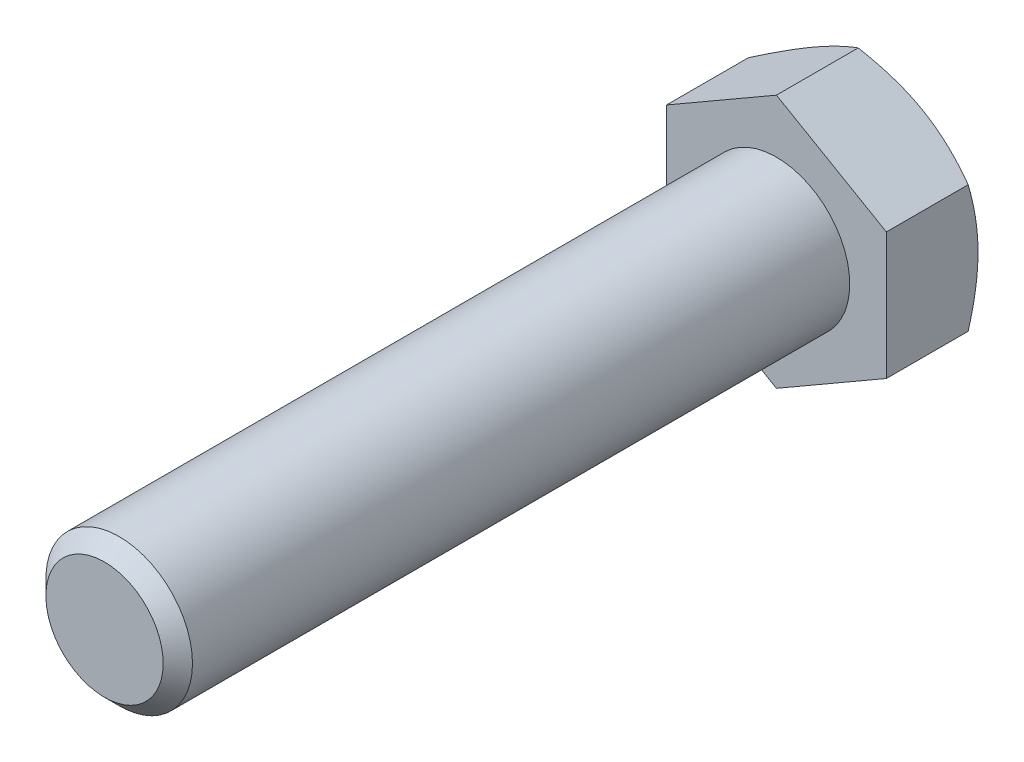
ISO-10303-21;
HEADER;
FILE_DESCRIPTION(('STEP AP214'),'2;1');
FILE_NAME('part.step','',(''),(''),'','','');
FILE_SCHEMA(('AUTOMOTIVE_DESIGN { 1 0 10303 214 1 1 1 1 }'));
ENDSEC;
DATA;
#1=APPLICATION_CONTEXT('core data for automotive mechanical design processes');
#2=APPLICATION_PROTOCOL_DEFINITION('international standard','automotive_design',2000,#1);
#3=PRODUCT_CONTEXT('',#1,'mechanical');
#4=PRODUCT('Part','Part','',(#3));
#5=PRODUCT_RELATED_PRODUCT_CATEGORY('part','',(#4));
#6=PRODUCT_DEFINITION_FORMATION('','',#4);
#7=PRODUCT_DEFINITION_CONTEXT('part definition',#1,'design');
#8=PRODUCT_DEFINITION('design','',#6,#7);
#9=PRODUCT_DEFINITION_SHAPE('','',#8);
#10=(LENGTH_UNIT() NAMED_UNIT(*) SI_UNIT(.MILLI.,.METRE.));
#11=(NAMED_UNIT(*) PLANE_ANGLE_UNIT() SI_UNIT($,.RADIAN.));
#12=(NAMED_UNIT(*) SI_UNIT($,.STERADIAN.) SOLID_ANGLE_UNIT());
#13=UNCERTAINTY_MEASURE_WITH_UNIT(LENGTH_MEASURE(1.E-05),#10,'distance_accuracy_value','');
#14=(GEOMETRIC_REPRESENTATION_CONTEXT(3) GLOBAL_UNCERTAINTY_ASSIGNED_CONTEXT((#13)) GLOBAL_UNIT_ASSIGNED_CONTEXT((#10,
#11,#12)) REPRESENTATION_CONTEXT('',''));
#15=CARTESIAN_POINT('',(0.,0.,0.));
#16=DIRECTION('',(0.,0.,1.));
#17=DIRECTION('',(1.,0.,0.));
#18=AXIS2_PLACEMENT_3D('',#15,#16,#17);
#19=CARTESIAN_POINT('',(0.,0.,55.));
#20=DIRECTION('',(0.,0.,1.));
#21=DIRECTION('',(1.,0.,0.));
#22=AXIS2_PLACEMENT_3D('',#19,#20,#21);
#23=PLANE('',#22);
#24=CARTESIAN_POINT('',(0.,0.,55.));
#25=DIRECTION('',(0.,0.,1.));
#26=DIRECTION('',(1.,0.,0.));
#27=AXIS2_PLACEMENT_3D('',#24,#25,#26);
#28=CIRCLE('',#27,4.80000000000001);
#29=CARTESIAN_POINT('',(4.80000000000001,0.,55.));
#30=VERTEX_POINT('',#29);
#31=EDGE_CURVE('E269',#30,#30,#28,.T.);
#32=ORIENTED_EDGE('',*,*,#31,.T.);
#33=EDGE_LOOP('',(#32));
#34=FACE_BOUND('',#33,.T.);
#35=ADVANCED_FACE('F38',(#34),#23,.T.);
#36=CARTESIAN_POINT('',(0.,0.,0.));
#37=DIRECTION('',(0.,0.,1.));
#38=DIRECTION('',(1.,0.,0.));
#39=AXIS2_PLACEMENT_3D('',#36,#37,#38);
#40=CYLINDRICAL_SURFACE('',#39,6.);
#41=CARTESIAN_POINT('',(0.,0.,53.8));
#42=DIRECTION('',(0.,0.,1.));
#43=DIRECTION('',(1.,0.,0.));
#44=AXIS2_PLACEMENT_3D('',#41,#42,#43);
#45=CIRCLE('',#44,6.);
#46=CARTESIAN_POINT('',(6.00000000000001,0.,53.8));
#47=VERTEX_POINT('',#46);
#48=EDGE_CURVE('E240',#47,#47,#45,.F.);
#49=ORIENTED_EDGE('',*,*,#48,.T.);
#50=EDGE_LOOP('',(#49));
#51=FACE_BOUND('',#50,.T.);
#52=CARTESIAN_POINT('',(0.,0.,0.));
#53=DIRECTION('',(0.,0.,1.));
#54=DIRECTION('',(1.,0.,0.));
#55=AXIS2_PLACEMENT_3D('',#52,#53,#54);
#56=CIRCLE('',#55,6.);
#57=CARTESIAN_POINT('',(6.,0.,0.));
#58=VERTEX_POINT('',#57);
#59=EDGE_CURVE('E266',#58,#58,#56,.F.);
#60=ORIENTED_EDGE('',*,*,#59,.F.);
#61=EDGE_LOOP('',(#60));
#62=FACE_BOUND('',#61,.T.);
#63=ADVANCED_FACE('F204',(#51,#62),#40,.T.);
#64=CARTESIAN_POINT('',(0.,0.,55.));
#65=DIRECTION('',(0.,0.,-1.));
#66=DIRECTION('',(-1.,0.,0.));
#67=AXIS2_PLACEMENT_3D('',#64,#65,#66);
#68=CONICAL_SURFACE('',#67,4.80000000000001,0.785398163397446);
#69=ORIENTED_EDGE('',*,*,#48,.F.);
#70=EDGE_LOOP('',(#69));
#71=FACE_BOUND('',#70,.T.);
#72=ORIENTED_EDGE('',*,*,#31,.F.);
#73=EDGE_LOOP('',(#72));
#74=FACE_BOUND('',#73,.T.);
#75=ADVANCED_FACE('F40',(#71,#74),#68,.T.);
#76=CARTESIAN_POINT('',(0.,10.3923048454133,-7.5));
#77=DIRECTION('',(0.499999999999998,0.86602540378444,0.));
#78=DIRECTION('',(-0.86602540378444,0.499999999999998,0.));
#79=AXIS2_PLACEMENT_3D('',#76,#77,#78);
#80=PLANE('',#79);
#81=CARTESIAN_POINT('',(-0.00020000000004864,10.3924203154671,-6.69608575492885));
#82=CARTESIAN_POINT('',(0.197607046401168,10.2782163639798,-6.76201799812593));
#83=CARTESIAN_POINT('',(0.396185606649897,10.1635669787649,-6.82495859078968));
#84=CARTESIAN_POINT('',(0.794955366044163,9.93333715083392,-6.94403100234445));
#85=CARTESIAN_POINT('',(0.995147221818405,9.8177563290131,-7.00015988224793));
#86=CARTESIAN_POINT('',(1.39751505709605,9.5854491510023,-7.10484803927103));
#87=CARTESIAN_POINT('',(1.59969459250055,9.46872074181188,-7.15338922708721));
#88=CARTESIAN_POINT('',(2.0054287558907,9.23447001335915,-7.24185148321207));
#89=CARTESIAN_POINT('',(2.20898309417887,9.11694786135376,-7.28177431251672));
#90=CARTESIAN_POINT('',(2.61230590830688,8.88408932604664,-7.35131532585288));
#91=CARTESIAN_POINT('',(2.81204459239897,8.76877014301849,-7.3811624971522));
#92=CARTESIAN_POINT('',(3.21241567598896,8.53761579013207,-7.43120669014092));
#93=CARTESIAN_POINT('',(3.41304799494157,8.42178066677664,-7.45140456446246));
#94=CARTESIAN_POINT('',(3.81466063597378,8.18990950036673,-7.48164565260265));
#95=CARTESIAN_POINT('',(4.0156403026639,8.07387383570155,-7.4917003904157));
#96=CARTESIAN_POINT('',(4.41778459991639,7.84169571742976,-7.50143766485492));
#97=CARTESIAN_POINT('',(4.61894922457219,7.7255532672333,-7.50112052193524));
#98=CARTESIAN_POINT('',(4.99503261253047,7.50842142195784,-7.49083604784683));
#99=CARTESIAN_POINT('',(5.16997789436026,7.40741671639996,-7.4821232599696));
#100=CARTESIAN_POINT('',(5.51945867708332,7.2056438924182,-7.45702265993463));
#101=CARTESIAN_POINT('',(5.69399414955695,7.10487579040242,-7.44063433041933));
#102=CARTESIAN_POINT('',(6.21692487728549,6.80296159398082,-7.38034344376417));
#103=CARTESIAN_POINT('',(6.5643945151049,6.60234990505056,-7.32532251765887));
#104=CARTESIAN_POINT('',(7.26301962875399,6.19899850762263,-7.18776952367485));
#105=CARTESIAN_POINT('',(7.61408594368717,5.99631027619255,-7.10465438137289));
#106=CARTESIAN_POINT('',(8.3109833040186,5.59395639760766,-6.91601746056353));
#107=CARTESIAN_POINT('',(8.65682327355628,5.39428559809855,-6.81053998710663));
#108=CARTESIAN_POINT('',(9.0002,5.19603695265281,-6.69608575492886));
#109=B_SPLINE_CURVE_WITH_KNOTS('',3,(#81,#82,#83,#84,#85,#86,#87,#88,#89,#90,#91,#92,#93,#94,
#95,#96,#97,#98,#99,#100,#101,#102,#103,#104,#105,#106,#107,#108),.UNSPECIFIED.,.F.,.F.,(4,2,2,
2,2,2,2,2,2,2,2,2,2,4),(0.,0.713219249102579,1.42674513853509,2.14194697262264,2.85700253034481,
3.55449749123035,4.25193080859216,4.94857085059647,5.64518936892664,6.25162976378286,
6.85811104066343,8.07193747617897,9.31268391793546,10.5509947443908),.UNSPECIFIED.);
#110=CARTESIAN_POINT('',(0.,10.3923048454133,-6.69615242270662));
#111=VERTEX_POINT('',#110);
#112=CARTESIAN_POINT('',(4.49999999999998,7.79422863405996,-7.5));
#113=VERTEX_POINT('',#112);
#114=EDGE_CURVE('E228',#111,#113,#109,.T.);
#115=ORIENTED_EDGE('',*,*,#114,.F.);
#116=DIRECTION('',(0.,0.,1.));
#117=VECTOR('',#116,1.);
#118=CARTESIAN_POINT('',(0.,10.3923048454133,-7.5));
#119=LINE('',#118,#117);
#120=CARTESIAN_POINT('',(0.,10.3923048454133,0.));
#121=VERTEX_POINT('',#120);
#122=EDGE_CURVE('E225',#111,#121,#119,.T.);
#123=ORIENTED_EDGE('',*,*,#122,.T.);
#124=DIRECTION('',(-0.86602540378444,0.499999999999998,0.));
#125=VECTOR('',#124,1.);
#126=CARTESIAN_POINT('',(0.,10.3923048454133,0.));
#127=LINE('',#126,#125);
#128=CARTESIAN_POINT('',(9.00000000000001,5.19615242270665,0.));
#129=VERTEX_POINT('',#128);
#130=EDGE_CURVE('E233',#129,#121,#127,.T.);
#131=ORIENTED_EDGE('',*,*,#130,.F.);
#132=DIRECTION('',(0.,0.,1.));
#133=VECTOR('',#132,1.);
#134=CARTESIAN_POINT('',(9.00000000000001,5.19615242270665,-7.5));
#135=LINE('',#134,#133);
#136=CARTESIAN_POINT('',(9.00000000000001,5.19615242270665,-6.69615242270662));
#137=VERTEX_POINT('',#136);
#138=EDGE_CURVE('E258',#137,#129,#135,.T.);
#139=ORIENTED_EDGE('',*,*,#138,.F.);
#140=EDGE_CURVE('E178',#113,#137,#109,.T.);
#141=ORIENTED_EDGE('',*,*,#140,.F.);
#142=EDGE_LOOP('',(#115,#123,#131,#139,#141));
#143=FACE_BOUND('',#142,.T.);
#144=ADVANCED_FACE('F188',(#143),#80,.T.);
#145=CARTESIAN_POINT('',(9.00000000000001,-5.19615242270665,-7.5));
#146=DIRECTION('',(1.,0.,0.));
#147=DIRECTION('',(0.,0.,-1.));
#148=AXIS2_PLACEMENT_3D('',#145,#146,#147);
#149=PLANE('',#148);
#150=CARTESIAN_POINT('',(9.00000000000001,-14.1938054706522,-2.99281770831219));
#151=CARTESIAN_POINT('',(9.00000000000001,-13.7986249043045,-3.18545400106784));
#152=CARTESIAN_POINT('',(9.00000000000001,-13.4025620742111,-3.37631016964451));
#153=CARTESIAN_POINT('',(9.00000000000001,-12.6082034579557,-3.75346543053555));
#154=CARTESIAN_POINT('',(9.00000000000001,-12.2099073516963,-3.93976384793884));
#155=CARTESIAN_POINT('',(9.00000000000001,-11.4086732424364,-4.30769386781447));
#156=CARTESIAN_POINT('',(9.00000000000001,-11.005721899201,-4.48929651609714));
#157=CARTESIAN_POINT('',(9.00000000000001,-10.1966954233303,-4.84537774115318));
#158=CARTESIAN_POINT('',(9.00000000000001,-9.79062043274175,-5.01985663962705));
#159=CARTESIAN_POINT('',(9.00000000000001,-8.96081603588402,-5.36560228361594));
#160=CARTESIAN_POINT('',(9.00000000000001,-8.53695616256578,-5.5365575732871));
#161=CARTESIAN_POINT('',(9.00000000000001,-7.68436682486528,-5.86609252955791));
#162=CARTESIAN_POINT('',(9.00000000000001,-7.25563683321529,-6.02467084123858));
#163=CARTESIAN_POINT('',(9.00000000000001,-6.39334839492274,-6.3254614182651));
#164=CARTESIAN_POINT('',(9.00000000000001,-5.95980093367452,-6.46770484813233));
#165=CARTESIAN_POINT('',(9.00000000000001,-5.08650675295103,-6.73142002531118));
#166=CARTESIAN_POINT('',(9.00000000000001,-4.64676195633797,-6.85289806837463));
#167=CARTESIAN_POINT('',(9.00000000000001,-3.7631885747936,-7.06875933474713));
#168=CARTESIAN_POINT('',(9.00000000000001,-3.31939822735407,-7.16329494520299));
#169=CARTESIAN_POINT('',(9.00000000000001,-2.64948950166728,-7.28091249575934));
#170=CARTESIAN_POINT('',(9.00000000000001,-2.42546830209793,-7.31608884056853));
#171=CARTESIAN_POINT('',(9.00000000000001,-1.97623392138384,-7.37769613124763));
#172=CARTESIAN_POINT('',(9.00000000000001,-1.75102085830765,-7.40412792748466));
#173=CARTESIAN_POINT('',(9.00000000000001,-1.30274989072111,-7.44737513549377));
#174=CARTESIAN_POINT('',(9.00000000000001,-1.07970414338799,-7.46431601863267));
#175=CARTESIAN_POINT('',(9.00000000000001,-0.633095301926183,-7.4887410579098));
#176=CARTESIAN_POINT('',(9.00000000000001,-0.409532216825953,-7.49622537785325));
#177=CARTESIAN_POINT('',(9.00000000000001,0.0377121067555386,-7.50155767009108));
#178=CARTESIAN_POINT('',(9.00000000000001,0.261393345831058,-7.49940559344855));
#179=CARTESIAN_POINT('',(9.00000000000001,0.708460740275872,-7.48552018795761));
#180=CARTESIAN_POINT('',(9.00000000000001,0.931846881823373,-7.47378642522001));
#181=CARTESIAN_POINT('',(9.00000000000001,1.46162752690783,-7.43485039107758));
#182=CARTESIAN_POINT('',(9.00000000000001,1.76772399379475,-7.40349650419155));
#183=CARTESIAN_POINT('',(9.00000000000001,2.37778404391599,-7.32445593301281));
#184=CARTESIAN_POINT('',(9.00000000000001,2.6817473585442,-7.27676722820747));
#185=CARTESIAN_POINT('',(9.00000000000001,3.59000335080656,-7.1117163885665));
#186=CARTESIAN_POINT('',(9.00000000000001,4.19036603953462,-6.9723942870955));
#187=CARTESIAN_POINT('',(9.00000000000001,5.08858153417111,-6.72898039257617));
#188=CARTESIAN_POINT('',(9.00000000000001,5.39104017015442,-6.64089135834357));
#189=CARTESIAN_POINT('',(9.00000000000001,5.99302412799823,-6.4551143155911));
#190=CARTESIAN_POINT('',(9.00000000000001,6.29254942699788,-6.35742623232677));
#191=CARTESIAN_POINT('',(9.00000000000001,6.88875586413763,-6.15405553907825));
#192=CARTESIAN_POINT('',(9.00000000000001,7.18543776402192,-6.0483751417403));
#193=CARTESIAN_POINT('',(9.00000000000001,7.77631041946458,-5.83030807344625));
#194=CARTESIAN_POINT('',(9.00000000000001,8.07050123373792,-5.71792156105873));
#195=CARTESIAN_POINT('',(9.00000000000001,8.86768097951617,-5.40462740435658));
#196=CARTESIAN_POINT('',(9.00000000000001,9.36851420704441,-5.19823951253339));
#197=CARTESIAN_POINT('',(9.00000000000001,10.3649647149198,-4.77318997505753));
#198=CARTESIAN_POINT('',(9.00000000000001,10.860581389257,-4.5545269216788));
#199=CARTESIAN_POINT('',(9.00000000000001,11.8478077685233,-4.10785524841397));
#200=CARTESIAN_POINT('',(9.00000000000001,12.3394158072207,-3.87984295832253));
#201=CARTESIAN_POINT('',(9.00000000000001,13.3192435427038,-3.41672758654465));
#202=CARTESIAN_POINT('',(9.00000000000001,13.8074633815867,-3.18162480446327));
#203=CARTESIAN_POINT('',(9.00000000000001,14.7819931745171,-2.70549247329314));
#204=CARTESIAN_POINT('',(9.00000000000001,15.2682986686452,-2.46445381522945));
#205=CARTESIAN_POINT('',(9.00000000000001,16.2387067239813,-1.97797920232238));
#206=CARTESIAN_POINT('',(9.00000000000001,16.7228092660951,-1.73254320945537));
#207=CARTESIAN_POINT('',(9.00000000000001,17.6890969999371,-1.23819989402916));
#208=CARTESIAN_POINT('',(9.00000000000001,18.1712826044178,-0.989293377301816));
#209=CARTESIAN_POINT('',(9.00000000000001,19.1341609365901,-0.48860773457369));
#210=CARTESIAN_POINT('',(9.00000000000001,19.6148536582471,-0.236828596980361));
#211=CARTESIAN_POINT('',(9.00000000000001,20.9522159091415,0.46783942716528));
#212=CARTESIAN_POINT('',(9.00000000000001,21.8075292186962,0.92330168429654));
#213=CARTESIAN_POINT('',(9.00000000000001,23.5152984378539,1.83966951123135));
#214=CARTESIAN_POINT('',(9.00000000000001,24.3677541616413,2.3005754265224));
#215=CARTESIAN_POINT('',(9.00000000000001,26.0675482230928,3.22485857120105));
#216=CARTESIAN_POINT('',(9.00000000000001,26.9148940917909,3.68822195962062));
#217=CARTESIAN_POINT('',(9.00000000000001,28.1846057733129,4.38556367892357));
#218=CARTESIAN_POINT('',(9.00000000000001,28.6076082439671,4.61838432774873));
#219=CARTESIAN_POINT('',(9.00000000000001,29.4532343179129,5.08471147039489));
#220=CARTESIAN_POINT('',(9.00000000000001,29.8758579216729,5.31821796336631));
#221=CARTESIAN_POINT('',(9.00000000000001,30.2983153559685,5.55202477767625));
#222=B_SPLINE_CURVE_WITH_KNOTS('',3,(#150,#151,#152,#153,#154,#155,#156,#157,#158,#159,#160,
#161,#162,#163,#164,#165,#166,#167,#168,#169,#170,#171,#172,#173,#174,#175,#176,#177,#178,#179,
#180,#181,#182,#183,#184,#185,#186,#187,#188,#189,#190,#191,#192,#193,#194,#195,#196,#197,#198,
#199,#200,#201,#202,#203,#204,#205,#206,#207,#208,#209,#210,#211,#212,#213,#214,#215,#216,#217,
#218,#219,#220,#221),.UNSPECIFIED.,.F.,.F.,(4,2,2,2,2,2,2,2,2,2,2,2,2,2,2,2,2,2,2,2,2,2,2,2,2,2,
2,2,2,2,2,2,2,2,2,4),(0.,1.31891143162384,2.63801699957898,3.9639117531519,5.28974656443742,
6.66070766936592,8.03181864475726,9.40026868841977,10.7683030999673,12.1284389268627,
12.8085936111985,13.488682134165,14.1595537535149,14.8304137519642,15.5012771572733,
16.172170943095,17.094749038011,18.0174412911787,19.8637129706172,20.808703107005,
21.7537006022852,22.6984374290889,23.6431519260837,25.267980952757,26.8929966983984,
28.5186565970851,30.1442479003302,31.7725119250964,33.4007900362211,35.0286961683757,
36.6566088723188,39.5636489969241,42.4708746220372,45.3681585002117,46.8166845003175,
48.2652087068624),.UNSPECIFIED.);
#223=CARTESIAN_POINT('',(9.,0.,-7.5));
#224=VERTEX_POINT('',#223);
#225=EDGE_CURVE('E176',#137,#224,#222,.F.);
#226=ORIENTED_EDGE('',*,*,#225,.F.);
#227=ORIENTED_EDGE('',*,*,#138,.T.);
#228=DIRECTION('',(0.,1.,0.));
#229=VECTOR('',#228,1.);
#230=CARTESIAN_POINT('',(9.00000000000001,-5.19615242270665,0.));
#231=LINE('',#230,#229);
#232=CARTESIAN_POINT('',(9.00000000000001,-5.19615242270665,0.));
#233=VERTEX_POINT('',#232);
#234=EDGE_CURVE('E265',#233,#129,#231,.T.);
#235=ORIENTED_EDGE('',*,*,#234,.F.);
#236=DIRECTION('',(0.,0.,1.));
#237=VECTOR('',#236,1.);
#238=CARTESIAN_POINT('',(9.00000000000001,-5.19615242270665,-7.5));
#239=LINE('',#238,#237);
#240=CARTESIAN_POINT('',(9.00000000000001,-5.19615242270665,-6.69615242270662));
#241=VERTEX_POINT('',#240);
#242=EDGE_CURVE('E243',#241,#233,#239,.T.);
#243=ORIENTED_EDGE('',*,*,#242,.F.);
#244=EDGE_CURVE('E171',#224,#241,#222,.F.);
#245=ORIENTED_EDGE('',*,*,#244,.F.);
#246=EDGE_LOOP('',(#226,#227,#235,#243,#245));
#247=FACE_BOUND('',#246,.T.);
#248=ADVANCED_FACE('F184',(#247),#149,.T.);
#249=CARTESIAN_POINT('',(0.,-10.3923048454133,-7.5));
#250=DIRECTION('',(0.499999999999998,-0.86602540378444,0.));
#251=DIRECTION('',(0.86602540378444,0.499999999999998,0.));
#252=AXIS2_PLACEMENT_3D('',#249,#250,#251);
#253=PLANE('',#252);
#254=CARTESIAN_POINT('',(9.0002,-5.19603695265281,-6.69608575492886));
#255=CARTESIAN_POINT('',(8.80239295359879,-5.31024090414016,-6.76201799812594));
#256=CARTESIAN_POINT('',(8.60381439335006,-5.42489028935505,-6.82495859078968));
#257=CARTESIAN_POINT('',(8.20504463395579,-5.65512011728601,-6.94403100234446));
#258=CARTESIAN_POINT('',(8.00485277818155,-5.77070093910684,-7.00015988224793));
#259=CARTESIAN_POINT('',(7.6024849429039,-6.00300811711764,-7.10484803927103));
#260=CARTESIAN_POINT('',(7.4003054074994,-6.11973652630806,-7.15338922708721));
#261=CARTESIAN_POINT('',(6.99457124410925,-6.35398725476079,-7.24185148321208));
#262=CARTESIAN_POINT('',(6.79101690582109,-6.47150940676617,-7.28177431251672));
#263=CARTESIAN_POINT('',(6.38769409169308,-6.70436794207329,-7.35131532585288));
#264=CARTESIAN_POINT('',(6.18795540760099,-6.81968712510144,-7.3811624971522));
#265=CARTESIAN_POINT('',(5.787584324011,-7.05084147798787,-7.43120669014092));
#266=CARTESIAN_POINT('',(5.58695200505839,-7.16667660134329,-7.45140456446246));
#267=CARTESIAN_POINT('',(5.18533936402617,-7.3985477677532,-7.48164565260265));
#268=CARTESIAN_POINT('',(4.98435969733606,-7.51458343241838,-7.4917003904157));
#269=CARTESIAN_POINT('',(4.58221540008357,-7.74676155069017,-7.50143766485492));
#270=CARTESIAN_POINT('',(4.38105077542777,-7.86290400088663,-7.50112052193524));
#271=CARTESIAN_POINT('',(4.00496738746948,-8.08003584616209,-7.49083604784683));
#272=CARTESIAN_POINT('',(3.83002210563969,-8.18104055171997,-7.4821232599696));
#273=CARTESIAN_POINT('',(3.48054132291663,-8.38281337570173,-7.45702265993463));
#274=CARTESIAN_POINT('',(3.30600585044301,-8.48358147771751,-7.44063433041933));
#275=CARTESIAN_POINT('',(2.78307512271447,-8.78549567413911,-7.38034344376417));
#276=CARTESIAN_POINT('',(2.43560548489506,-8.98610736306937,-7.32532251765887));
#277=CARTESIAN_POINT('',(1.73698037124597,-9.38945876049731,-7.18776952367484));
#278=CARTESIAN_POINT('',(1.38591405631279,-9.59214699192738,-7.10465438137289));
#279=CARTESIAN_POINT('',(0.689016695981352,-9.99450087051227,-6.91601746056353));
#280=CARTESIAN_POINT('',(0.343176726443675,-10.1941716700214,-6.81053998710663));
#281=CARTESIAN_POINT('',(-0.000200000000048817,-10.3924203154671,-6.69608575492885));
#282=B_SPLINE_CURVE_WITH_KNOTS('',3,(#254,#255,#256,#257,#258,#259,#260,#261,#262,#263,#264,
#265,#266,#267,#268,#269,#270,#271,#272,#273,#274,#275,#276,#277,#278,#279,#280,#281),
.UNSPECIFIED.,.F.,.F.,(4,2,2,2,2,2,2,2,2,2,2,2,2,4),(0.,0.71321924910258,1.42674513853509,
2.14194697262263,2.85700253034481,3.55449749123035,4.25193080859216,4.94857085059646,
5.64518936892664,6.25162976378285,6.85811104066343,8.07193747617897,9.31268391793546,
10.5509947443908),.UNSPECIFIED.);
#283=CARTESIAN_POINT('',(4.49999999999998,-7.79422863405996,-7.5));
#284=VERTEX_POINT('',#283);
#285=EDGE_CURVE('E177',#241,#284,#282,.T.);
#286=ORIENTED_EDGE('',*,*,#285,.F.);
#287=ORIENTED_EDGE('',*,*,#242,.T.);
#288=DIRECTION('',(0.86602540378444,0.499999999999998,0.));
#289=VECTOR('',#288,1.);
#290=CARTESIAN_POINT('',(0.,-10.3923048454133,0.));
#291=LINE('',#290,#289);
#292=CARTESIAN_POINT('',(0.,-10.3923048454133,0.));
#293=VERTEX_POINT('',#292);
#294=EDGE_CURVE('E254',#293,#233,#291,.T.);
#295=ORIENTED_EDGE('',*,*,#294,.F.);
#296=DIRECTION('',(0.,0.,1.));
#297=VECTOR('',#296,1.);
#298=CARTESIAN_POINT('',(0.,-10.3923048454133,-7.5));
#299=LINE('',#298,#297);
#300=CARTESIAN_POINT('',(0.,-10.3923048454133,-6.69615242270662));
#301=VERTEX_POINT('',#300);
#302=EDGE_CURVE('E253',#301,#293,#299,.T.);
#303=ORIENTED_EDGE('',*,*,#302,.F.);
#304=EDGE_CURVE('E165',#284,#301,#282,.T.);
#305=ORIENTED_EDGE('',*,*,#304,.F.);
#306=EDGE_LOOP('',(#286,#287,#295,#303,#305));
#307=FACE_BOUND('',#306,.T.);
#308=ADVANCED_FACE('F187',(#307),#253,.T.);
#309=CARTESIAN_POINT('',(0.,-10.3923048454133,-7.5));
#310=DIRECTION('',(-0.500000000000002,-0.866025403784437,0.));
#311=DIRECTION('',(0.866025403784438,-0.500000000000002,0.));
#312=AXIS2_PLACEMENT_3D('',#309,#310,#311);
#313=PLANE('',#312);
#314=CARTESIAN_POINT('',(0.000199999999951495,-10.3924203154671,-6.69608575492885));
#315=CARTESIAN_POINT('',(-0.197607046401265,-10.2782163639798,-6.76201799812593));
#316=CARTESIAN_POINT('',(-0.396185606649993,-10.1635669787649,-6.82495859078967));
#317=CARTESIAN_POINT('',(-0.794955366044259,-9.93333715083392,-6.94403100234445));
#318=CARTESIAN_POINT('',(-0.9951472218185,-9.81775632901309,-7.00015988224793));
#319=CARTESIAN_POINT('',(-1.39751505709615,-9.58544915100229,-7.10484803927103));
#320=CARTESIAN_POINT('',(-1.59969459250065,-9.46872074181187,-7.1533892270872));
#321=CARTESIAN_POINT('',(-2.0054287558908,-9.23447001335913,-7.24185148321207));
#322=CARTESIAN_POINT('',(-2.20898309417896,-9.11694786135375,-7.28177431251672));
#323=CARTESIAN_POINT('',(-2.61230590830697,-8.88408932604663,-7.35131532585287));
#324=CARTESIAN_POINT('',(-2.81204459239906,-8.76877014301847,-7.38116249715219));
#325=CARTESIAN_POINT('',(-3.21241567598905,-8.53761579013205,-7.43120669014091));
#326=CARTESIAN_POINT('',(-3.41304799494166,-8.42178066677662,-7.45140456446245));
#327=CARTESIAN_POINT('',(-3.81466063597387,-8.18990950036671,-7.48164565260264));
#328=CARTESIAN_POINT('',(-4.01564030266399,-8.07387383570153,-7.49170039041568));
#329=CARTESIAN_POINT('',(-4.41778459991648,-7.84169571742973,-7.5014376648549));
#330=CARTESIAN_POINT('',(-4.61894922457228,-7.72555326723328,-7.50112052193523));
#331=CARTESIAN_POINT('',(-4.99503261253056,-7.50842142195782,-7.49083604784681));
#332=CARTESIAN_POINT('',(-5.16997789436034,-7.40741671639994,-7.48212325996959));
#333=CARTESIAN_POINT('',(-5.51945867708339,-7.20564389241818,-7.45702265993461));
#334=CARTESIAN_POINT('',(-5.69399414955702,-7.1048757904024,-7.44063433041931));
#335=CARTESIAN_POINT('',(-6.21692487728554,-6.8029615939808,-7.38034344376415));
#336=CARTESIAN_POINT('',(-6.56439451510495,-6.60234990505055,-7.32532251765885));
#337=CARTESIAN_POINT('',(-7.26301962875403,-6.19899850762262,-7.18776952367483));
#338=CARTESIAN_POINT('',(-7.6140859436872,-5.99631027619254,-7.10465438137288));
#339=CARTESIAN_POINT('',(-8.31098330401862,-5.59395639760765,-6.91601746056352));
#340=CARTESIAN_POINT('',(-8.65682327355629,-5.39428559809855,-6.81053998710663));
#341=CARTESIAN_POINT('',(-9.0002,-5.19603695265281,-6.69608575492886));
#342=B_SPLINE_CURVE_WITH_KNOTS('',3,(#314,#315,#316,#317,#318,#319,#320,#321,#322,#323,#324,
#325,#326,#327,#328,#329,#330,#331,#332,#333,#334,#335,#336,#337,#338,#339,#340,#341),
.UNSPECIFIED.,.F.,.F.,(4,2,2,2,2,2,2,2,2,2,2,2,2,4),(0.,0.713219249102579,1.42674513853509,
2.14194697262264,2.85700253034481,3.55449749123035,4.25193080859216,4.94857085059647,
5.64518936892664,6.25162976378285,6.85811104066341,8.07193747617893,9.31268391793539,
10.5509947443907),.UNSPECIFIED.);
#343=CARTESIAN_POINT('',(-4.50000000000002,-7.79422863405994,-7.5));
#344=VERTEX_POINT('',#343);
#345=EDGE_CURVE('E249',#301,#344,#342,.T.);
#346=ORIENTED_EDGE('',*,*,#345,.F.);
#347=ORIENTED_EDGE('',*,*,#302,.T.);
#348=DIRECTION('',(0.866025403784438,-0.500000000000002,0.));
#349=VECTOR('',#348,1.);
#350=CARTESIAN_POINT('',(0.,-10.3923048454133,0.));
#351=LINE('',#350,#349);
#352=CARTESIAN_POINT('',(-9.00000000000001,-5.19615242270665,0.));
#353=VERTEX_POINT('',#352);
#354=EDGE_CURVE('E391',#353,#293,#351,.T.);
#355=ORIENTED_EDGE('',*,*,#354,.F.);
#356=DIRECTION('',(0.,0.,1.));
#357=VECTOR('',#356,1.);
#358=CARTESIAN_POINT('',(-9.00000000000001,-5.19615242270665,-7.5));
#359=LINE('',#358,#357);
#360=CARTESIAN_POINT('',(-9.00000000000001,-5.19615242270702,-6.69615242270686));
#361=VERTEX_POINT('',#360);
#362=EDGE_CURVE('E256',#361,#353,#359,.T.);
#363=ORIENTED_EDGE('',*,*,#362,.F.);
#364=EDGE_CURVE('E115',#344,#361,#342,.T.);
#365=ORIENTED_EDGE('',*,*,#364,.F.);
#366=EDGE_LOOP('',(#346,#347,#355,#363,#365));
#367=FACE_BOUND('',#366,.T.);
#368=ADVANCED_FACE('F193',(#367),#313,.T.);
#369=CARTESIAN_POINT('',(-9.00000000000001,-5.19615242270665,-7.5));
#370=DIRECTION('',(-1.,0.,0.));
#371=DIRECTION('',(0.,0.,1.));
#372=AXIS2_PLACEMENT_3D('',#369,#370,#371);
#373=PLANE('',#372);
#374=CARTESIAN_POINT('',(-9.00000000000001,-14.1938054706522,-2.99281770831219));
#375=CARTESIAN_POINT('',(-9.00000000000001,-13.7986249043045,-3.18545400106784));
#376=CARTESIAN_POINT('',(-9.00000000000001,-13.4025620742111,-3.37631016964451));
#377=CARTESIAN_POINT('',(-9.00000000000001,-12.6082034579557,-3.75346543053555));
#378=CARTESIAN_POINT('',(-9.00000000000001,-12.2099073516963,-3.93976384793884));
#379=CARTESIAN_POINT('',(-9.00000000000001,-11.4086732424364,-4.30769386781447));
#380=CARTESIAN_POINT('',(-9.00000000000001,-11.005721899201,-4.48929651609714));
#381=CARTESIAN_POINT('',(-9.00000000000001,-10.1966954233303,-4.84537774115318));
#382=CARTESIAN_POINT('',(-9.00000000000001,-9.79062043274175,-5.01985663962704));
#383=CARTESIAN_POINT('',(-9.00000000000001,-8.96081603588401,-5.36560228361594));
#384=CARTESIAN_POINT('',(-9.00000000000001,-8.53695616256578,-5.5365575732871));
#385=CARTESIAN_POINT('',(-9.00000000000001,-7.68436682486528,-5.86609252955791));
#386=CARTESIAN_POINT('',(-9.00000000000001,-7.25563683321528,-6.02467084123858));
#387=CARTESIAN_POINT('',(-9.00000000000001,-6.39334839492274,-6.3254614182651));
#388=CARTESIAN_POINT('',(-9.00000000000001,-5.95980093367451,-6.46770484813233));
#389=CARTESIAN_POINT('',(-9.00000000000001,-5.08650675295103,-6.73142002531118));
#390=CARTESIAN_POINT('',(-9.00000000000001,-4.64676195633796,-6.85289806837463));
#391=CARTESIAN_POINT('',(-9.00000000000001,-3.76318857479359,-7.06875933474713));
#392=CARTESIAN_POINT('',(-9.00000000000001,-3.31939822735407,-7.16329494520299));
#393=CARTESIAN_POINT('',(-9.00000000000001,-2.64948950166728,-7.28091249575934));
#394=CARTESIAN_POINT('',(-9.00000000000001,-2.42546830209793,-7.31608884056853));
#395=CARTESIAN_POINT('',(-9.00000000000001,-1.97623392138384,-7.37769613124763));
#396=CARTESIAN_POINT('',(-9.00000000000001,-1.75102085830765,-7.40412792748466));
#397=CARTESIAN_POINT('',(-9.00000000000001,-1.30274989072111,-7.44737513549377));
#398=CARTESIAN_POINT('',(-9.00000000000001,-1.07970414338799,-7.46431601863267));
#399=CARTESIAN_POINT('',(-9.00000000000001,-0.633095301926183,-7.4887410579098));
#400=CARTESIAN_POINT('',(-9.00000000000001,-0.409532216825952,-7.49622537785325));
#401=CARTESIAN_POINT('',(-9.00000000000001,0.0377121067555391,-7.50155767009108));
#402=CARTESIAN_POINT('',(-9.00000000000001,0.261393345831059,-7.49940559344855));
#403=CARTESIAN_POINT('',(-9.00000000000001,0.708460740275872,-7.48552018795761));
#404=CARTESIAN_POINT('',(-9.00000000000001,0.931846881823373,-7.47378642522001));
#405=CARTESIAN_POINT('',(-9.00000000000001,1.46162752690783,-7.43485039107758));
#406=CARTESIAN_POINT('',(-9.00000000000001,1.76772399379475,-7.40349650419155));
#407=CARTESIAN_POINT('',(-9.00000000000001,2.37778404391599,-7.32445593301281));
#408=CARTESIAN_POINT('',(-9.00000000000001,2.6817473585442,-7.27676722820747));
#409=CARTESIAN_POINT('',(-9.00000000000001,3.59000335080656,-7.1117163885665));
#410=CARTESIAN_POINT('',(-9.00000000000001,4.19036603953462,-6.9723942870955));
#411=CARTESIAN_POINT('',(-9.00000000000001,5.08858153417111,-6.72898039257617));
#412=CARTESIAN_POINT('',(-9.00000000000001,5.39104017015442,-6.64089135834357));
#413=CARTESIAN_POINT('',(-9.00000000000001,5.99302412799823,-6.4551143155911));
#414=CARTESIAN_POINT('',(-9.00000000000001,6.29254942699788,-6.35742623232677));
#415=CARTESIAN_POINT('',(-9.00000000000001,6.88875586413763,-6.15405553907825));
#416=CARTESIAN_POINT('',(-9.00000000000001,7.18543776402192,-6.0483751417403));
#417=CARTESIAN_POINT('',(-9.00000000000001,7.77631041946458,-5.83030807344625));
#418=CARTESIAN_POINT('',(-9.00000000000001,8.07050123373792,-5.71792156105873));
#419=CARTESIAN_POINT('',(-9.00000000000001,8.86768097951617,-5.40462740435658));
#420=CARTESIAN_POINT('',(-9.00000000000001,9.36851420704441,-5.19823951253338));
#421=CARTESIAN_POINT('',(-9.00000000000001,10.3649647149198,-4.77318997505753));
#422=CARTESIAN_POINT('',(-9.00000000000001,10.860581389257,-4.55452692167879));
#423=CARTESIAN_POINT('',(-9.00000000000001,11.8478077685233,-4.10785524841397));
#424=CARTESIAN_POINT('',(-9.00000000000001,12.3394158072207,-3.87984295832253));
#425=CARTESIAN_POINT('',(-9.00000000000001,13.3192435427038,-3.41672758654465));
#426=CARTESIAN_POINT('',(-9.00000000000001,13.8074633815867,-3.18162480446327));
#427=CARTESIAN_POINT('',(-9.00000000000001,14.7819931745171,-2.70549247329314));
#428=CARTESIAN_POINT('',(-9.00000000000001,15.2682986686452,-2.46445381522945));
#429=CARTESIAN_POINT('',(-9.00000000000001,16.2387067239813,-1.97797920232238));
#430=CARTESIAN_POINT('',(-9.00000000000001,16.722809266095,-1.73254320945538));
#431=CARTESIAN_POINT('',(-9.00000000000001,17.6890969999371,-1.23819989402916));
#432=CARTESIAN_POINT('',(-9.00000000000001,18.1712826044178,-0.989293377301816));
#433=CARTESIAN_POINT('',(-9.00000000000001,19.1341609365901,-0.48860773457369));
#434=CARTESIAN_POINT('',(-9.00000000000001,19.6148536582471,-0.236828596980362));
#435=CARTESIAN_POINT('',(-9.00000000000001,20.9522159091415,0.467839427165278));
#436=CARTESIAN_POINT('',(-9.00000000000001,21.8075292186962,0.923301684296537));
#437=CARTESIAN_POINT('',(-9.00000000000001,23.5152984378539,1.83966951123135));
#438=CARTESIAN_POINT('',(-9.00000000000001,24.3677541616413,2.3005754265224));
#439=CARTESIAN_POINT('',(-9.00000000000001,26.0675482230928,3.22485857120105));
#440=CARTESIAN_POINT('',(-9.00000000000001,26.9148940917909,3.68822195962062));
#441=CARTESIAN_POINT('',(-9.00000000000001,28.184605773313,4.38556367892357));
#442=CARTESIAN_POINT('',(-9.00000000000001,28.6076082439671,4.61838432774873));
#443=CARTESIAN_POINT('',(-9.00000000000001,29.4532343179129,5.08471147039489));
#444=CARTESIAN_POINT('',(-9.00000000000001,29.8758579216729,5.31821796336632));
#445=CARTESIAN_POINT('',(-9.00000000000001,30.2983153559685,5.55202477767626));
#446=B_SPLINE_CURVE_WITH_KNOTS('',3,(#374,#375,#376,#377,#378,#379,#380,#381,#382,#383,#384,
#385,#386,#387,#388,#389,#390,#391,#392,#393,#394,#395,#396,#397,#398,#399,#400,#401,#402,#403,
#404,#405,#406,#407,#408,#409,#410,#411,#412,#413,#414,#415,#416,#417,#418,#419,#420,#421,#422,
#423,#424,#425,#426,#427,#428,#429,#430,#431,#432,#433,#434,#435,#436,#437,#438,#439,#440,#441,
#442,#443,#444,#445),.UNSPECIFIED.,.F.,.F.,(4,2,2,2,2,2,2,2,2,2,2,2,2,2,2,2,2,2,2,2,2,2,2,2,2,2,
2,2,2,2,2,2,2,2,2,4),(0.,1.31891143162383,2.63801699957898,3.9639117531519,5.28974656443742,
6.66070766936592,8.03181864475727,9.40026868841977,10.7683030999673,12.1284389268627,
12.8085936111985,13.488682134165,14.1595537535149,14.8304137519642,15.5012771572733,
16.172170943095,17.094749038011,18.0174412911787,19.8637129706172,20.808703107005,
21.7537006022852,22.6984374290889,23.6431519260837,25.267980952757,26.8929966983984,
28.5186565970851,30.1442479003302,31.7725119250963,33.400790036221,35.0286961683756,
36.6566088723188,39.5636489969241,42.4708746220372,45.3681585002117,46.8166845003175,
48.2652087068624),.UNSPECIFIED.);
#447=CARTESIAN_POINT('',(-9.00000000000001,0.,-7.5));
#448=VERTEX_POINT('',#447);
#449=EDGE_CURVE('E110',#361,#448,#446,.T.);
#450=ORIENTED_EDGE('',*,*,#449,.F.);
#451=ORIENTED_EDGE('',*,*,#362,.T.);
#452=DIRECTION('',(0.,-1.,0.));
#453=VECTOR('',#452,1.);
#454=CARTESIAN_POINT('',(-9.00000000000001,-5.19615242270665,0.));
#455=LINE('',#454,#453);
#456=CARTESIAN_POINT('',(-9.00000000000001,5.19615242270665,0.));
#457=VERTEX_POINT('',#456);
#458=EDGE_CURVE('E393',#457,#353,#455,.T.);
#459=ORIENTED_EDGE('',*,*,#458,.F.);
#460=DIRECTION('',(0.,0.,1.));
#461=VECTOR('',#460,1.);
#462=CARTESIAN_POINT('',(-9.00000000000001,5.19615242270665,-7.5));
#463=LINE('',#462,#461);
#464=CARTESIAN_POINT('',(-9.00000000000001,5.19615242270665,-6.69615242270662));
#465=VERTEX_POINT('',#464);
#466=EDGE_CURVE('E136',#465,#457,#463,.T.);
#467=ORIENTED_EDGE('',*,*,#466,.F.);
#468=EDGE_CURVE('E119',#448,#465,#446,.T.);
#469=ORIENTED_EDGE('',*,*,#468,.F.);
#470=EDGE_LOOP('',(#450,#451,#459,#467,#469));
#471=FACE_BOUND('',#470,.T.);
#472=ADVANCED_FACE('F134',(#471),#373,.T.);
#473=CARTESIAN_POINT('',(-9.00000000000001,5.19615242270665,-7.5));
#474=DIRECTION('',(-0.500000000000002,0.866025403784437,0.));
#475=DIRECTION('',(-0.866025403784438,-0.500000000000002,0.));
#476=AXIS2_PLACEMENT_3D('',#473,#474,#475);
#477=PLANE('',#476);
#478=CARTESIAN_POINT('',(-9.0002,5.19603695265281,-6.69608575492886));
#479=CARTESIAN_POINT('',(-8.80239295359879,5.31024090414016,-6.76201799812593));
#480=CARTESIAN_POINT('',(-8.60381439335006,5.42489028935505,-6.82495859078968));
#481=CARTESIAN_POINT('',(-8.20504463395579,5.65512011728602,-6.94403100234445));
#482=CARTESIAN_POINT('',(-8.00485277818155,5.77070093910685,-7.00015988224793));
#483=CARTESIAN_POINT('',(-7.6024849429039,6.00300811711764,-7.10484803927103));
#484=CARTESIAN_POINT('',(-7.40030540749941,6.11973652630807,-7.15338922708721));
#485=CARTESIAN_POINT('',(-6.99457124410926,6.3539872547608,-7.24185148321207));
#486=CARTESIAN_POINT('',(-6.79101690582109,6.47150940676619,-7.28177431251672));
#487=CARTESIAN_POINT('',(-6.38769409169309,6.70436794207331,-7.35131532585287));
#488=CARTESIAN_POINT('',(-6.187955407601,6.81968712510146,-7.38116249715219));
#489=CARTESIAN_POINT('',(-5.787584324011,7.05084147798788,-7.43120669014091));
#490=CARTESIAN_POINT('',(-5.58695200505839,7.16667660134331,-7.45140456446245));
#491=CARTESIAN_POINT('',(-5.18533936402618,7.39854776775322,-7.48164565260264));
#492=CARTESIAN_POINT('',(-4.98435969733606,7.5145834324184,-7.49170039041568));
#493=CARTESIAN_POINT('',(-4.58221540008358,7.7467615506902,-7.5014376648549));
#494=CARTESIAN_POINT('',(-4.38105077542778,7.86290400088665,-7.50112052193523));
#495=CARTESIAN_POINT('',(-4.0049673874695,8.08003584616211,-7.49083604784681));
#496=CARTESIAN_POINT('',(-3.83002210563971,8.18104055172,-7.48212325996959));
#497=CARTESIAN_POINT('',(-3.48054132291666,8.38281337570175,-7.45702265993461));
#498=CARTESIAN_POINT('',(-3.30600585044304,8.48358147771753,-7.44063433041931));
#499=CARTESIAN_POINT('',(-2.78307512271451,8.78549567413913,-7.38034344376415));
#500=CARTESIAN_POINT('',(-2.4356054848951,8.98610736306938,-7.32532251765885));
#501=CARTESIAN_POINT('',(-1.73698037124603,9.38945876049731,-7.18776952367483));
#502=CARTESIAN_POINT('',(-1.38591405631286,9.59214699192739,-7.10465438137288));
#503=CARTESIAN_POINT('',(-0.689016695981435,9.99450087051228,-6.91601746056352));
#504=CARTESIAN_POINT('',(-0.343176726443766,10.1941716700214,-6.81053998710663));
#505=CARTESIAN_POINT('',(0.000199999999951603,10.3924203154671,-6.69608575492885));
#506=B_SPLINE_CURVE_WITH_KNOTS('',3,(#478,#479,#480,#481,#482,#483,#484,#485,#486,#487,#488,
#489,#490,#491,#492,#493,#494,#495,#496,#497,#498,#499,#500,#501,#502,#503,#504,#505),
.UNSPECIFIED.,.F.,.F.,(4,2,2,2,2,2,2,2,2,2,2,2,2,4),(0.,0.71321924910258,1.42674513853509,
2.14194697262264,2.85700253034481,3.55449749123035,4.25193080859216,4.94857085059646,
5.64518936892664,6.25162976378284,6.8581110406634,8.07193747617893,9.31268391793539,
10.5509947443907),.UNSPECIFIED.);
#507=CARTESIAN_POINT('',(-4.50000000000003,7.79422863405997,-7.5));
#508=VERTEX_POINT('',#507);
#509=EDGE_CURVE('E125',#465,#508,#506,.T.);
#510=ORIENTED_EDGE('',*,*,#509,.F.);
#511=ORIENTED_EDGE('',*,*,#466,.T.);
#512=DIRECTION('',(-0.866025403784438,-0.500000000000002,0.));
#513=VECTOR('',#512,1.);
#514=CARTESIAN_POINT('',(-9.00000000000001,5.19615242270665,0.));
#515=LINE('',#514,#513);
#516=EDGE_CURVE('E235',#121,#457,#515,.T.);
#517=ORIENTED_EDGE('',*,*,#516,.F.);
#518=ORIENTED_EDGE('',*,*,#122,.F.);
#519=EDGE_CURVE('E127',#508,#111,#506,.T.);
#520=ORIENTED_EDGE('',*,*,#519,.F.);
#521=EDGE_LOOP('',(#510,#511,#517,#518,#520));
#522=FACE_BOUND('',#521,.T.);
#523=ADVANCED_FACE('F201',(#522),#477,.T.);
#524=CARTESIAN_POINT('',(9.00000000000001,5.19615242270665,0.));
#525=DIRECTION('',(0.,0.,1.));
#526=DIRECTION('',(1.,0.,0.));
#527=AXIS2_PLACEMENT_3D('',#524,#525,#526);
#528=PLANE('',#527);
#529=ORIENTED_EDGE('',*,*,#59,.T.);
#530=EDGE_LOOP('',(#529));
#531=FACE_BOUND('',#530,.T.);
#532=ORIENTED_EDGE('',*,*,#130,.T.);
#533=ORIENTED_EDGE('',*,*,#516,.T.);
#534=ORIENTED_EDGE('',*,*,#458,.T.);
#535=ORIENTED_EDGE('',*,*,#354,.T.);
#536=ORIENTED_EDGE('',*,*,#294,.T.);
#537=ORIENTED_EDGE('',*,*,#234,.T.);
#538=EDGE_LOOP('',(#532,#533,#534,#535,#536,#537));
#539=FACE_BOUND('',#538,.T.);
#540=ADVANCED_FACE('F190',(#531,#539),#528,.T.);
#541=CARTESIAN_POINT('',(0.,0.,0.));
#542=DIRECTION('',(0.,0.,1.));
#543=DIRECTION('',(1.,0.,0.));
#544=AXIS2_PLACEMENT_3D('',#541,#542,#543);
#545=CONICAL_SURFACE('',#544,21.9903810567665,1.0471975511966);
#546=ORIENTED_EDGE('',*,*,#140,.T.);
#547=ORIENTED_EDGE('',*,*,#225,.T.);
#548=CARTESIAN_POINT('',(0.,0.,-7.5));
#549=DIRECTION('',(0.,0.,1.));
#550=DIRECTION('',(1.,0.,0.));
#551=AXIS2_PLACEMENT_3D('',#548,#549,#550);
#552=CIRCLE('',#551,9.);
#553=EDGE_CURVE('E42',#113,#224,#552,.F.);
#554=ORIENTED_EDGE('',*,*,#553,.F.);
#555=EDGE_LOOP('',(#546,#547,#554));
#556=FACE_BOUND('',#555,.T.);
#557=ADVANCED_FACE('F221',(#556),#545,.T.);
#558=ORIENTED_EDGE('',*,*,#114,.T.);
#559=EDGE_CURVE('E132',#508,#113,#552,.F.);
#560=ORIENTED_EDGE('',*,*,#559,.F.);
#561=ORIENTED_EDGE('',*,*,#519,.T.);
#562=EDGE_LOOP('',(#558,#560,#561));
#563=FACE_BOUND('',#562,.T.);
#564=ADVANCED_FACE('F157',(#563),#545,.T.);
#565=ORIENTED_EDGE('',*,*,#468,.T.);
#566=ORIENTED_EDGE('',*,*,#509,.T.);
#567=CARTESIAN_POINT('',(0.,0.,-7.5));
#568=DIRECTION('',(0.,0.,-1.));
#569=DIRECTION('',(-1.,0.,0.));
#570=AXIS2_PLACEMENT_3D('',#567,#568,#569);
#571=CIRCLE('',#570,9.00000000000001);
#572=EDGE_CURVE('E60',#448,#508,#571,.T.);
#573=ORIENTED_EDGE('',*,*,#572,.F.);
#574=EDGE_LOOP('',(#565,#566,#573));
#575=FACE_BOUND('',#574,.T.);
#576=ADVANCED_FACE('F123',(#575),#545,.T.);
#577=ORIENTED_EDGE('',*,*,#364,.T.);
#578=ORIENTED_EDGE('',*,*,#449,.T.);
#579=EDGE_CURVE('E112',#344,#448,#552,.F.);
#580=ORIENTED_EDGE('',*,*,#579,.F.);
#581=EDGE_LOOP('',(#577,#578,#580));
#582=FACE_BOUND('',#581,.T.);
#583=ADVANCED_FACE('F111',(#582),#545,.T.);
#584=ORIENTED_EDGE('',*,*,#304,.T.);
#585=ORIENTED_EDGE('',*,*,#345,.T.);
#586=EDGE_CURVE('E47',#284,#344,#552,.F.);
#587=ORIENTED_EDGE('',*,*,#586,.F.);
#588=EDGE_LOOP('',(#584,#585,#587));
#589=FACE_BOUND('',#588,.T.);
#590=ADVANCED_FACE('F251',(#589),#545,.T.);
#591=ORIENTED_EDGE('',*,*,#244,.T.);
#592=ORIENTED_EDGE('',*,*,#285,.T.);
#593=EDGE_CURVE('E11',#224,#284,#552,.F.);
#594=ORIENTED_EDGE('',*,*,#593,.F.);
#595=EDGE_LOOP('',(#591,#592,#594));
#596=FACE_BOUND('',#595,.T.);
#597=ADVANCED_FACE('F245',(#596),#545,.T.);
#598=CARTESIAN_POINT('',(9.00000000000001,5.19615242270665,-7.5));
#599=DIRECTION('',(0.,0.,1.));
#600=DIRECTION('',(1.,0.,0.));
#601=AXIS2_PLACEMENT_3D('',#598,#599,#600);
#602=PLANE('',#601);
#603=ORIENTED_EDGE('',*,*,#553,.T.);
#604=ORIENTED_EDGE('',*,*,#593,.T.);
#605=ORIENTED_EDGE('',*,*,#586,.T.);
#606=ORIENTED_EDGE('',*,*,#579,.T.);
#607=ORIENTED_EDGE('',*,*,#572,.T.);
#608=ORIENTED_EDGE('',*,*,#559,.T.);
#609=EDGE_LOOP('',(#603,#604,#605,#606,#607,#608));
#610=FACE_BOUND('',#609,.T.);
#611=ADVANCED_FACE('F130',(#610),#602,.F.);
#612=CLOSED_SHELL('',(#35,#63,#75,#144,#248,#308,#368,#472,#523,#540,#557,#564,#576,#583,#590,
#597,#611));
#613=MANIFOLD_SOLID_BREP('B2',#612);
#614=ADVANCED_BREP_SHAPE_REPRESENTATION('',(#18,#613),#14);
#615=SHAPE_DEFINITION_REPRESENTATION(#9,#614);
ENDSEC;
END-ISO-10303-21;
